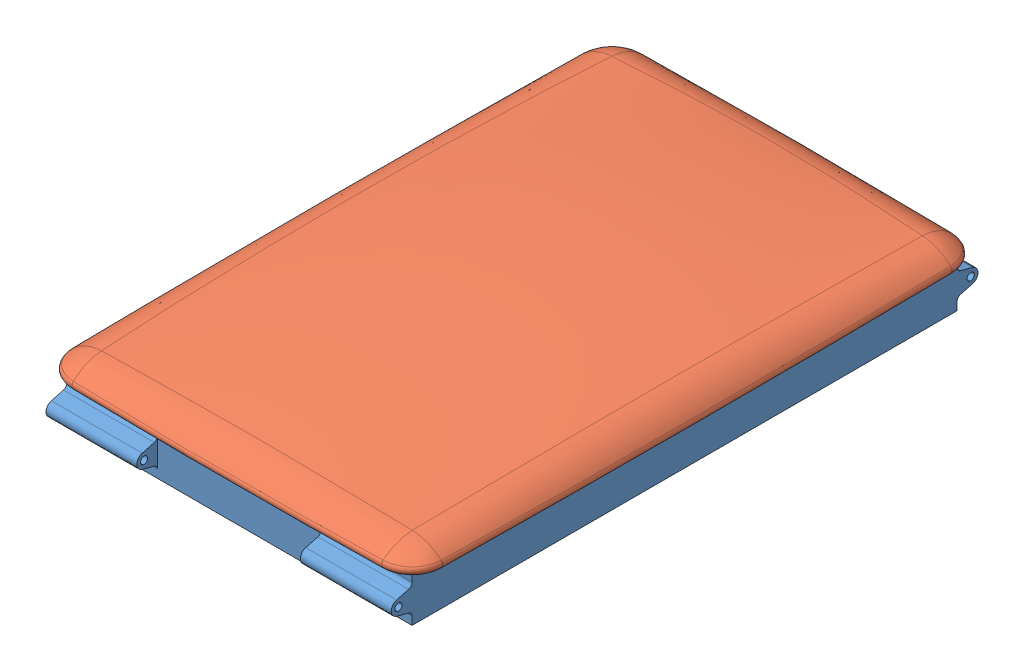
SolidWorks assembly Middle.sldasm, configuration Default (file format 11000). Lengths in mm.
Overall size (416.79 91.39 646).
2 component instances, 2 part files, 0 mates.
Components (placement in the parent):
- Couch_center-1: Couch_center.SLDPRT [Default] at origin size (380 50 646)
- Middle_pad-1: Middle_pad.sldprt [Default] at (0 10 0) x (-1 0 0) z (0 1 0) size (416.79 638.66 41.46)
